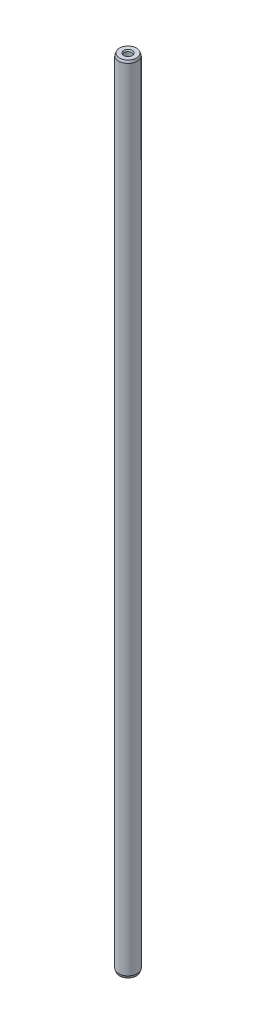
ISO-10303-21;
HEADER;
FILE_DESCRIPTION(('STEP AP214'),'2;1');
FILE_NAME('part.step','',(''),(''),'','','');
FILE_SCHEMA(('AUTOMOTIVE_DESIGN { 1 0 10303 214 1 1 1 1 }'));
ENDSEC;
DATA;
#1=APPLICATION_CONTEXT('core data for automotive mechanical design processes');
#2=APPLICATION_PROTOCOL_DEFINITION('international standard','automotive_design',2000,#1);
#3=PRODUCT_CONTEXT('',#1,'mechanical');
#4=PRODUCT('Part','Part','',(#3));
#5=PRODUCT_RELATED_PRODUCT_CATEGORY('part','',(#4));
#6=PRODUCT_DEFINITION_FORMATION('','',#4);
#7=PRODUCT_DEFINITION_CONTEXT('part definition',#1,'design');
#8=PRODUCT_DEFINITION('design','',#6,#7);
#9=PRODUCT_DEFINITION_SHAPE('','',#8);
#10=(LENGTH_UNIT() NAMED_UNIT(*) SI_UNIT(.MILLI.,.METRE.));
#11=(NAMED_UNIT(*) PLANE_ANGLE_UNIT() SI_UNIT($,.RADIAN.));
#12=(NAMED_UNIT(*) SI_UNIT($,.STERADIAN.) SOLID_ANGLE_UNIT());
#13=UNCERTAINTY_MEASURE_WITH_UNIT(LENGTH_MEASURE(1.E-05),#10,'distance_accuracy_value','');
#14=(GEOMETRIC_REPRESENTATION_CONTEXT(3) GLOBAL_UNCERTAINTY_ASSIGNED_CONTEXT((#13)) GLOBAL_UNIT_ASSIGNED_CONTEXT((#10,
#11,#12)) REPRESENTATION_CONTEXT('',''));
#15=CARTESIAN_POINT('',(0.,0.,0.));
#16=DIRECTION('',(0.,0.,1.));
#17=DIRECTION('',(1.,0.,0.));
#18=AXIS2_PLACEMENT_3D('',#15,#16,#17);
#19=CARTESIAN_POINT('',(-1.06592274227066,129.485936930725,-1.12643595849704));
#20=DIRECTION('',(0.,-1.,0.));
#21=DIRECTION('',(0.,0.,-1.));
#22=AXIS2_PLACEMENT_3D('',#19,#20,#21);
#23=PLANE('',#22);
#24=CARTESIAN_POINT('',(-1.06592274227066,129.485936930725,-1.12643595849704));
#25=DIRECTION('',(0.,-1.,0.));
#26=DIRECTION('',(0.,0.,-1.));
#27=AXIS2_PLACEMENT_3D('',#24,#25,#26);
#28=CIRCLE('',#27,1.3843);
#29=CARTESIAN_POINT('',(-1.06592274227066,129.485936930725,-2.51073595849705));
#30=VERTEX_POINT('',#29);
#31=EDGE_CURVE('E11',#30,#30,#28,.T.);
#32=ORIENTED_EDGE('',*,*,#31,.T.);
#33=EDGE_LOOP('',(#32));
#34=FACE_BOUND('',#33,.T.);
#35=CARTESIAN_POINT('',(-1.06592274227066,129.485936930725,-1.12643595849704));
#36=DIRECTION('',(0.,1.,0.));
#37=DIRECTION('',(0.,0.,1.));
#38=AXIS2_PLACEMENT_3D('',#35,#36,#37);
#39=CIRCLE('',#38,2.74319999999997);
#40=CARTESIAN_POINT('',(-1.06592274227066,129.485936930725,1.61676404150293));
#41=VERTEX_POINT('',#40);
#42=EDGE_CURVE('E55',#41,#41,#39,.T.);
#43=ORIENTED_EDGE('',*,*,#42,.T.);
#44=EDGE_LOOP('',(#43));
#45=FACE_BOUND('',#44,.T.);
#46=ADVANCED_FACE('F17',(#34,#45),#23,.F.);
#47=CARTESIAN_POINT('',(-1.06592274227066,128.723936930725,-1.12643595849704));
#48=DIRECTION('',(0.,-1.,0.));
#49=DIRECTION('',(0.,0.,-1.));
#50=AXIS2_PLACEMENT_3D('',#47,#48,#49);
#51=CONICAL_SURFACE('',#50,2.9972,0.321750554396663);
#52=ORIENTED_EDGE('',*,*,#42,.F.);
#53=EDGE_LOOP('',(#52));
#54=FACE_BOUND('',#53,.T.);
#55=CARTESIAN_POINT('',(-1.06592274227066,128.723936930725,-1.12643595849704));
#56=DIRECTION('',(0.,1.,0.));
#57=DIRECTION('',(0.,0.,1.));
#58=AXIS2_PLACEMENT_3D('',#55,#56,#57);
#59=CIRCLE('',#58,2.9972);
#60=CARTESIAN_POINT('',(-1.06592274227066,128.723936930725,1.87076404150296));
#61=VERTEX_POINT('',#60);
#62=EDGE_CURVE('E52',#61,#61,#59,.T.);
#63=ORIENTED_EDGE('',*,*,#62,.T.);
#64=EDGE_LOOP('',(#63));
#65=FACE_BOUND('',#64,.T.);
#66=ADVANCED_FACE('F76',(#54,#65),#51,.T.);
#67=CARTESIAN_POINT('',(-1.06592274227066,129.485936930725,-1.12643595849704));
#68=DIRECTION('',(0.,1.,0.));
#69=DIRECTION('',(0.,0.,1.));
#70=AXIS2_PLACEMENT_3D('',#67,#68,#69);
#71=CYLINDRICAL_SURFACE('',#70,2.9972);
#72=ORIENTED_EDGE('',*,*,#62,.F.);
#73=EDGE_LOOP('',(#72));
#74=FACE_BOUND('',#73,.T.);
#75=CARTESIAN_POINT('',(-1.06592274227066,-123.752063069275,-1.12643595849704));
#76=DIRECTION('',(0.,1.,0.));
#77=DIRECTION('',(0.,0.,1.));
#78=AXIS2_PLACEMENT_3D('',#75,#76,#77);
#79=CIRCLE('',#78,2.9972);
#80=CARTESIAN_POINT('',(-1.06592274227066,-123.752063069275,1.87076404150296));
#81=VERTEX_POINT('',#80);
#82=EDGE_CURVE('E49',#81,#81,#79,.T.);
#83=ORIENTED_EDGE('',*,*,#82,.T.);
#84=EDGE_LOOP('',(#83));
#85=FACE_BOUND('',#84,.T.);
#86=ADVANCED_FACE('F82',(#74,#85),#71,.T.);
#87=CARTESIAN_POINT('',(-1.06592274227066,-124.514063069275,-1.12643595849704));
#88=DIRECTION('',(0.,1.,0.));
#89=DIRECTION('',(0.,0.,1.));
#90=AXIS2_PLACEMENT_3D('',#87,#88,#89);
#91=CONICAL_SURFACE('',#90,2.74319999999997,0.321750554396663);
#92=ORIENTED_EDGE('',*,*,#82,.F.);
#93=EDGE_LOOP('',(#92));
#94=FACE_BOUND('',#93,.T.);
#95=CARTESIAN_POINT('',(-1.06592274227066,-124.514063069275,-1.12643595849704));
#96=DIRECTION('',(0.,1.,0.));
#97=DIRECTION('',(0.,0.,1.));
#98=AXIS2_PLACEMENT_3D('',#95,#96,#97);
#99=CIRCLE('',#98,2.74319999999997);
#100=CARTESIAN_POINT('',(-1.06592274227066,-124.514063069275,1.61676404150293));
#101=VERTEX_POINT('',#100);
#102=EDGE_CURVE('E44',#101,#101,#99,.T.);
#103=ORIENTED_EDGE('',*,*,#102,.T.);
#104=EDGE_LOOP('',(#103));
#105=FACE_BOUND('',#104,.T.);
#106=ADVANCED_FACE('F89',(#94,#105),#91,.T.);
#107=CARTESIAN_POINT('',(1.67727725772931,-124.514063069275,-1.12643595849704));
#108=DIRECTION('',(0.,1.,0.));
#109=DIRECTION('',(0.,0.,1.));
#110=AXIS2_PLACEMENT_3D('',#107,#108,#109);
#111=PLANE('',#110);
#112=CARTESIAN_POINT('',(-1.06592274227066,-124.514063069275,-1.12643595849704));
#113=DIRECTION('',(0.,1.,0.));
#114=DIRECTION('',(0.,0.,1.));
#115=AXIS2_PLACEMENT_3D('',#112,#113,#114);
#116=CIRCLE('',#115,1.3843);
#117=CARTESIAN_POINT('',(-1.06592274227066,-124.514063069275,0.257864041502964));
#118=VERTEX_POINT('',#117);
#119=EDGE_CURVE('E61',#118,#118,#116,.T.);
#120=ORIENTED_EDGE('',*,*,#119,.T.);
#121=EDGE_LOOP('',(#120));
#122=FACE_BOUND('',#121,.T.);
#123=ORIENTED_EDGE('',*,*,#102,.F.);
#124=EDGE_LOOP('',(#123));
#125=FACE_BOUND('',#124,.T.);
#126=ADVANCED_FACE('F93',(#122,#125),#111,.F.);
#127=CARTESIAN_POINT('',(-1.06592274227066,-124.514063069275,-1.12643595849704));
#128=DIRECTION('',(0.,-1.,0.));
#129=DIRECTION('',(0.,0.,-1.));
#130=AXIS2_PLACEMENT_3D('',#127,#128,#129);
#131=CYLINDRICAL_SURFACE('',#130,1.1303);
#132=CARTESIAN_POINT('',(-1.06592274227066,-124.074122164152,-1.12643595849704));
#133=DIRECTION('',(0.,1.,0.));
#134=DIRECTION('',(0.,0.,1.));
#135=AXIS2_PLACEMENT_3D('',#132,#133,#134);
#136=CIRCLE('',#135,1.1303);
#137=CARTESIAN_POINT('',(-1.06592274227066,-124.074122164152,0.00386404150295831));
#138=VERTEX_POINT('',#137);
#139=EDGE_CURVE('E58',#138,#138,#136,.F.);
#140=ORIENTED_EDGE('',*,*,#139,.T.);
#141=EDGE_LOOP('',(#140));
#142=FACE_BOUND('',#141,.T.);
#143=CARTESIAN_POINT('',(-1.06592274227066,-118.799063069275,-1.12643595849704));
#144=DIRECTION('',(0.,-1.,0.));
#145=DIRECTION('',(0.,0.,-1.));
#146=AXIS2_PLACEMENT_3D('',#143,#144,#145);
#147=CIRCLE('',#146,1.1303);
#148=CARTESIAN_POINT('',(-1.06592274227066,-118.799063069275,-2.25673595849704));
#149=VERTEX_POINT('',#148);
#150=EDGE_CURVE('E41',#149,#149,#147,.T.);
#151=ORIENTED_EDGE('',*,*,#150,.F.);
#152=EDGE_LOOP('',(#151));
#153=FACE_BOUND('',#152,.T.);
#154=ADVANCED_FACE('F97',(#142,#153),#131,.F.);
#155=CARTESIAN_POINT('',(-1.06592274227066,-118.799063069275,-1.12643595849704));
#156=DIRECTION('',(0.,-1.,0.));
#157=DIRECTION('',(0.,0.,-1.));
#158=AXIS2_PLACEMENT_3D('',#155,#156,#157);
#159=CONICAL_SURFACE('',#158,1.1303,1.02974425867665);
#160=CARTESIAN_POINT('',(-1.06592274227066,-118.119910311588,-1.12643595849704));
#161=VERTEX_POINT('',#160);
#162=VERTEX_LOOP('',#161);
#163=FACE_BOUND('',#162,.T.);
#164=ORIENTED_EDGE('',*,*,#150,.T.);
#165=EDGE_LOOP('',(#164));
#166=FACE_BOUND('',#165,.T.);
#167=ADVANCED_FACE('F101',(#163,#166),#159,.F.);
#168=CARTESIAN_POINT('',(-1.06592274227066,129.485936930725,-1.12643595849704));
#169=DIRECTION('',(0.,1.,0.));
#170=DIRECTION('',(0.,0.,1.));
#171=AXIS2_PLACEMENT_3D('',#168,#169,#170);
#172=CYLINDRICAL_SURFACE('',#171,1.1303);
#173=CARTESIAN_POINT('',(-1.06592274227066,129.045996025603,-1.12643595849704));
#174=DIRECTION('',(0.,-1.,0.));
#175=DIRECTION('',(0.,0.,-1.));
#176=AXIS2_PLACEMENT_3D('',#173,#174,#175);
#177=CIRCLE('',#176,1.1303);
#178=CARTESIAN_POINT('',(-1.06592274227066,129.045996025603,-2.25673595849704));
#179=VERTEX_POINT('',#178);
#180=EDGE_CURVE('E25',#179,#179,#177,.F.);
#181=ORIENTED_EDGE('',*,*,#180,.T.);
#182=EDGE_LOOP('',(#181));
#183=FACE_BOUND('',#182,.T.);
#184=CARTESIAN_POINT('',(-1.06592274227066,123.770936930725,-1.12643595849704));
#185=DIRECTION('',(0.,1.,0.));
#186=DIRECTION('',(0.,0.,1.));
#187=AXIS2_PLACEMENT_3D('',#184,#185,#186);
#188=CIRCLE('',#187,1.1303);
#189=CARTESIAN_POINT('',(-1.06592274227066,123.770936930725,0.00386404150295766));
#190=VERTEX_POINT('',#189);
#191=EDGE_CURVE('E39',#190,#190,#188,.T.);
#192=ORIENTED_EDGE('',*,*,#191,.F.);
#193=EDGE_LOOP('',(#192));
#194=FACE_BOUND('',#193,.T.);
#195=ADVANCED_FACE('F35',(#183,#194),#172,.F.);
#196=CARTESIAN_POINT('',(-1.06592274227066,123.770936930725,-1.12643595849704));
#197=DIRECTION('',(0.,1.,0.));
#198=DIRECTION('',(0.,0.,1.));
#199=AXIS2_PLACEMENT_3D('',#196,#197,#198);
#200=CONICAL_SURFACE('',#199,1.1303,1.02974425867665);
#201=CARTESIAN_POINT('',(-1.06592274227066,123.091784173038,-1.12643595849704));
#202=VERTEX_POINT('',#201);
#203=VERTEX_LOOP('',#202);
#204=FACE_BOUND('',#203,.T.);
#205=ORIENTED_EDGE('',*,*,#191,.T.);
#206=EDGE_LOOP('',(#205));
#207=FACE_BOUND('',#206,.T.);
#208=ADVANCED_FACE('F31',(#204,#207),#200,.F.);
#209=CARTESIAN_POINT('',(-1.06592274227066,-124.074122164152,-1.12643595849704));
#210=DIRECTION('',(0.,-1.,0.));
#211=DIRECTION('',(0.,0.,-1.));
#212=AXIS2_PLACEMENT_3D('',#209,#210,#211);
#213=CONICAL_SURFACE('',#212,1.1303,0.523598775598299);
#214=ORIENTED_EDGE('',*,*,#119,.F.);
#215=EDGE_LOOP('',(#214));
#216=FACE_BOUND('',#215,.T.);
#217=ORIENTED_EDGE('',*,*,#139,.F.);
#218=EDGE_LOOP('',(#217));
#219=FACE_BOUND('',#218,.T.);
#220=ADVANCED_FACE('F34',(#216,#219),#213,.F.);
#221=CARTESIAN_POINT('',(-1.06592274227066,129.045996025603,-1.12643595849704));
#222=DIRECTION('',(0.,1.,0.));
#223=DIRECTION('',(0.,0.,1.));
#224=AXIS2_PLACEMENT_3D('',#221,#222,#223);
#225=CONICAL_SURFACE('',#224,1.1303,0.523598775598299);
#226=ORIENTED_EDGE('',*,*,#31,.F.);
#227=EDGE_LOOP('',(#226));
#228=FACE_BOUND('',#227,.T.);
#229=ORIENTED_EDGE('',*,*,#180,.F.);
#230=EDGE_LOOP('',(#229));
#231=FACE_BOUND('',#230,.T.);
#232=ADVANCED_FACE('F19',(#228,#231),#225,.F.);
#233=CLOSED_SHELL('',(#46,#66,#86,#106,#126,#154,#167,#195,#208,#220,#232));
#234=MANIFOLD_SOLID_BREP('B1',#233);
#235=ADVANCED_BREP_SHAPE_REPRESENTATION('',(#18,#234),#14);
#236=SHAPE_DEFINITION_REPRESENTATION(#9,#235);
ENDSEC;
END-ISO-10303-21;
